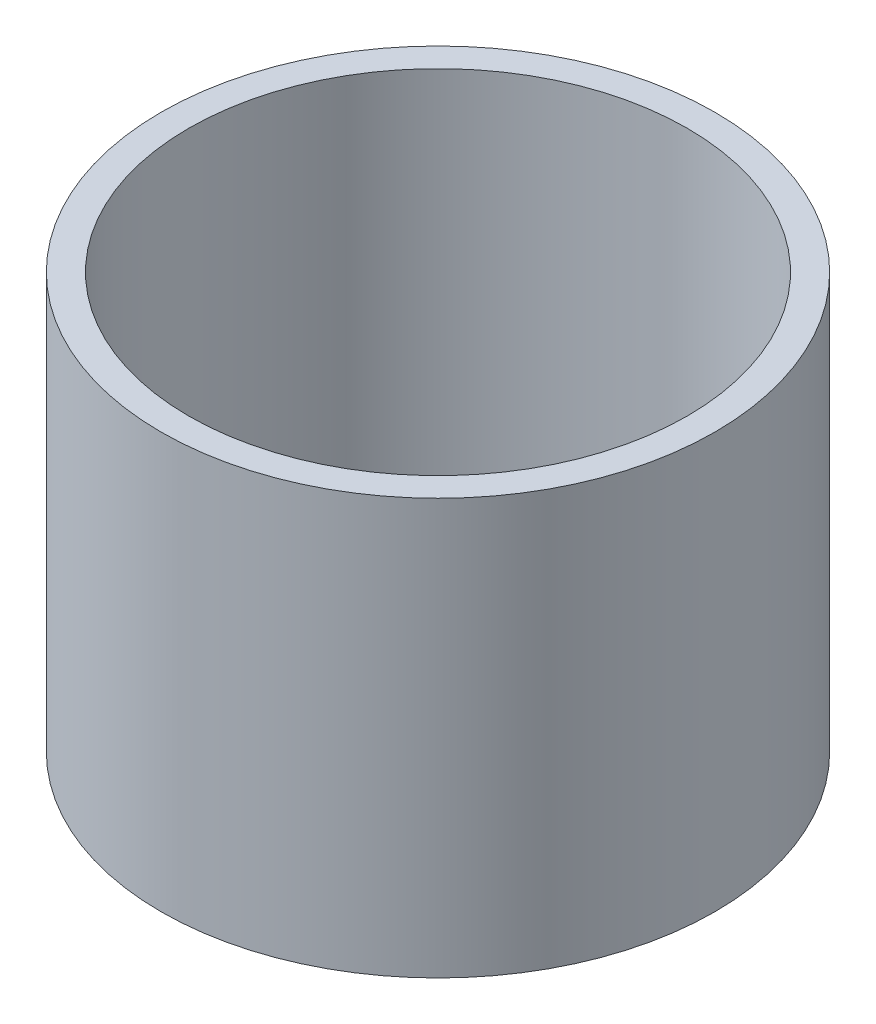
ISO-10303-21;
HEADER;
FILE_DESCRIPTION(('STEP AP214'),'2;1');
FILE_NAME('part.step','',(''),(''),'','','');
FILE_SCHEMA(('AUTOMOTIVE_DESIGN { 1 0 10303 214 1 1 1 1 }'));
ENDSEC;
DATA;
#1=APPLICATION_CONTEXT('core data for automotive mechanical design processes');
#2=APPLICATION_PROTOCOL_DEFINITION('international standard','automotive_design',2000,#1);
#3=PRODUCT_CONTEXT('',#1,'mechanical');
#4=PRODUCT('Part','Part','',(#3));
#5=PRODUCT_RELATED_PRODUCT_CATEGORY('part','',(#4));
#6=PRODUCT_DEFINITION_FORMATION('','',#4);
#7=PRODUCT_DEFINITION_CONTEXT('part definition',#1,'design');
#8=PRODUCT_DEFINITION('design','',#6,#7);
#9=PRODUCT_DEFINITION_SHAPE('','',#8);
#10=(LENGTH_UNIT() NAMED_UNIT(*) SI_UNIT(.MILLI.,.METRE.));
#11=(NAMED_UNIT(*) PLANE_ANGLE_UNIT() SI_UNIT($,.RADIAN.));
#12=(NAMED_UNIT(*) SI_UNIT($,.STERADIAN.) SOLID_ANGLE_UNIT());
#13=UNCERTAINTY_MEASURE_WITH_UNIT(LENGTH_MEASURE(1.E-05),#10,'distance_accuracy_value','');
#14=(GEOMETRIC_REPRESENTATION_CONTEXT(3) GLOBAL_UNCERTAINTY_ASSIGNED_CONTEXT((#13)) GLOBAL_UNIT_ASSIGNED_CONTEXT((#10,
#11,#12)) REPRESENTATION_CONTEXT('',''));
#15=CARTESIAN_POINT('',(0.,0.,0.));
#16=DIRECTION('',(0.,0.,1.));
#17=DIRECTION('',(1.,0.,0.));
#18=AXIS2_PLACEMENT_3D('',#15,#16,#17);
#19=CARTESIAN_POINT('',(0.,150.,0.));
#20=DIRECTION('',(0.,1.,0.));
#21=DIRECTION('',(0.,0.,1.));
#22=AXIS2_PLACEMENT_3D('',#19,#20,#21);
#23=PLANE('',#22);
#24=CARTESIAN_POINT('',(0.,150.,0.));
#25=DIRECTION('',(0.,1.,0.));
#26=DIRECTION('',(0.,0.,1.));
#27=AXIS2_PLACEMENT_3D('',#24,#25,#26);
#28=CIRCLE('',#27,100.);
#29=CARTESIAN_POINT('',(0.,150.,100.));
#30=VERTEX_POINT('',#29);
#31=EDGE_CURVE('E10',#30,#30,#28,.T.);
#32=ORIENTED_EDGE('',*,*,#31,.T.);
#33=EDGE_LOOP('',(#32));
#34=FACE_BOUND('',#33,.T.);
#35=CARTESIAN_POINT('',(0.,150.,0.));
#36=DIRECTION('',(0.,1.,0.));
#37=DIRECTION('',(0.,0.,1.));
#38=AXIS2_PLACEMENT_3D('',#35,#36,#37);
#39=CIRCLE('',#38,90.);
#40=CARTESIAN_POINT('',(0.,150.,90.));
#41=VERTEX_POINT('',#40);
#42=EDGE_CURVE('E50',#41,#41,#39,.T.);
#43=ORIENTED_EDGE('',*,*,#42,.F.);
#44=EDGE_LOOP('',(#43));
#45=FACE_BOUND('',#44,.T.);
#46=ADVANCED_FACE('F37',(#34,#45),#23,.T.);
#47=CARTESIAN_POINT('',(0.,0.,0.));
#48=DIRECTION('',(0.,1.,0.));
#49=DIRECTION('',(0.,0.,1.));
#50=AXIS2_PLACEMENT_3D('',#47,#48,#49);
#51=PLANE('',#50);
#52=CARTESIAN_POINT('',(0.,0.,0.));
#53=DIRECTION('',(0.,1.,0.));
#54=DIRECTION('',(0.,0.,1.));
#55=AXIS2_PLACEMENT_3D('',#52,#53,#54);
#56=CIRCLE('',#55,100.);
#57=CARTESIAN_POINT('',(0.,0.,100.));
#58=VERTEX_POINT('',#57);
#59=EDGE_CURVE('E41',#58,#58,#56,.T.);
#60=ORIENTED_EDGE('',*,*,#59,.F.);
#61=EDGE_LOOP('',(#60));
#62=FACE_BOUND('',#61,.T.);
#63=CARTESIAN_POINT('',(0.,0.,0.));
#64=DIRECTION('',(0.,1.,0.));
#65=DIRECTION('',(0.,0.,1.));
#66=AXIS2_PLACEMENT_3D('',#63,#64,#65);
#67=CIRCLE('',#66,90.);
#68=CARTESIAN_POINT('',(0.,0.,90.));
#69=VERTEX_POINT('',#68);
#70=EDGE_CURVE('E52',#69,#69,#67,.T.);
#71=ORIENTED_EDGE('',*,*,#70,.T.);
#72=EDGE_LOOP('',(#71));
#73=FACE_BOUND('',#72,.T.);
#74=ADVANCED_FACE('F64',(#62,#73),#51,.F.);
#75=CARTESIAN_POINT('',(0.,150.,0.));
#76=DIRECTION('',(0.,-1.,0.));
#77=DIRECTION('',(0.,0.,-1.));
#78=AXIS2_PLACEMENT_3D('',#75,#76,#77);
#79=CYLINDRICAL_SURFACE('',#78,100.);
#80=ORIENTED_EDGE('',*,*,#31,.F.);
#81=EDGE_LOOP('',(#80));
#82=FACE_BOUND('',#81,.T.);
#83=ORIENTED_EDGE('',*,*,#59,.T.);
#84=EDGE_LOOP('',(#83));
#85=FACE_BOUND('',#84,.T.);
#86=ADVANCED_FACE('F39',(#82,#85),#79,.T.);
#87=CARTESIAN_POINT('',(0.,150.,0.));
#88=DIRECTION('',(0.,-1.,0.));
#89=DIRECTION('',(0.,0.,-1.));
#90=AXIS2_PLACEMENT_3D('',#87,#88,#89);
#91=CYLINDRICAL_SURFACE('',#90,90.);
#92=ORIENTED_EDGE('',*,*,#42,.T.);
#93=EDGE_LOOP('',(#92));
#94=FACE_BOUND('',#93,.T.);
#95=ORIENTED_EDGE('',*,*,#70,.F.);
#96=EDGE_LOOP('',(#95));
#97=FACE_BOUND('',#96,.T.);
#98=ADVANCED_FACE('F60',(#94,#97),#91,.F.);
#99=CLOSED_SHELL('',(#46,#74,#86,#98));
#100=MANIFOLD_SOLID_BREP('B2',#99);
#101=ADVANCED_BREP_SHAPE_REPRESENTATION('',(#18,#100),#14);
#102=SHAPE_DEFINITION_REPRESENTATION(#9,#101);
ENDSEC;
END-ISO-10303-21;
